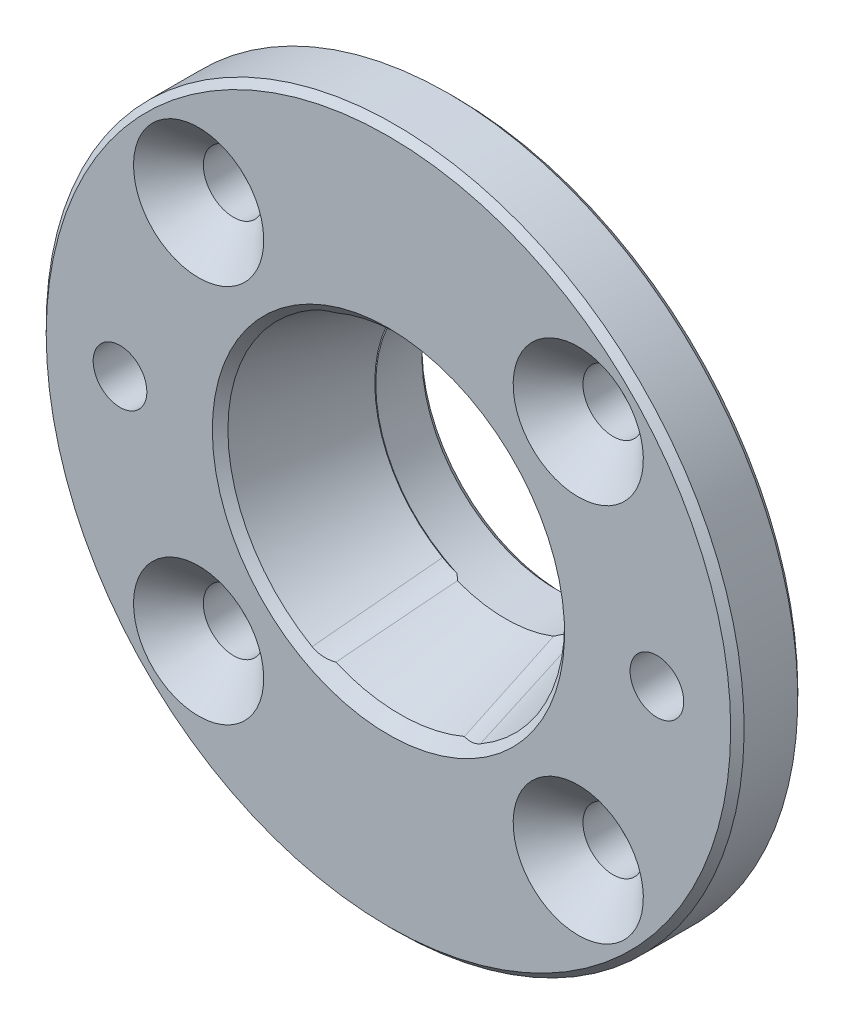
ISO-10303-21;
HEADER;
FILE_DESCRIPTION(('STEP AP214'),'2;1');
FILE_NAME('part.step','',(''),(''),'','','');
FILE_SCHEMA(('AUTOMOTIVE_DESIGN { 1 0 10303 214 1 1 1 1 }'));
ENDSEC;
DATA;
#1=APPLICATION_CONTEXT('core data for automotive mechanical design processes');
#2=APPLICATION_PROTOCOL_DEFINITION('international standard','automotive_design',2000,#1);
#3=PRODUCT_CONTEXT('',#1,'mechanical');
#4=PRODUCT('Part','Part','',(#3));
#5=PRODUCT_RELATED_PRODUCT_CATEGORY('part','',(#4));
#6=PRODUCT_DEFINITION_FORMATION('','',#4);
#7=PRODUCT_DEFINITION_CONTEXT('part definition',#1,'design');
#8=PRODUCT_DEFINITION('design','',#6,#7);
#9=PRODUCT_DEFINITION_SHAPE('','',#8);
#10=(LENGTH_UNIT() NAMED_UNIT(*) SI_UNIT(.MILLI.,.METRE.));
#11=(NAMED_UNIT(*) PLANE_ANGLE_UNIT() SI_UNIT($,.RADIAN.));
#12=(NAMED_UNIT(*) SI_UNIT($,.STERADIAN.) SOLID_ANGLE_UNIT());
#13=UNCERTAINTY_MEASURE_WITH_UNIT(LENGTH_MEASURE(1.E-05),#10,'distance_accuracy_value','');
#14=(GEOMETRIC_REPRESENTATION_CONTEXT(3) GLOBAL_UNCERTAINTY_ASSIGNED_CONTEXT((#13)) GLOBAL_UNIT_ASSIGNED_CONTEXT((#10,
#11,#12)) REPRESENTATION_CONTEXT('',''));
#15=CARTESIAN_POINT('',(0.,0.,0.));
#16=DIRECTION('',(0.,0.,1.));
#17=DIRECTION('',(1.,0.,0.));
#18=AXIS2_PLACEMENT_3D('',#15,#16,#17);
#19=CARTESIAN_POINT('',(0.,0.,-8.71853610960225));
#20=DIRECTION('',(0.,0.,1.));
#21=DIRECTION('',(0.,-1.,0.));
#22=AXIS2_PLACEMENT_3D('',#19,#20,#21);
#23=CONICAL_SURFACE('',#22,10.,0.279252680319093);
#24=CARTESIAN_POINT('',(0.,0.,-0.871853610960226));
#25=DIRECTION('',(0.,0.,-1.));
#26=DIRECTION('',(0.,1.,0.));
#27=AXIS2_PLACEMENT_3D('',#24,#25,#26);
#28=CIRCLE('',#27,12.25);
#29=CARTESIAN_POINT('',(-4.7905868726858,11.2744302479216,-0.871853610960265));
#30=VERTEX_POINT('',#29);
#31=CARTESIAN_POINT('',(4.7905868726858,11.2744302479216,-0.871853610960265));
#32=VERTEX_POINT('',#31);
#33=EDGE_CURVE('E107',#30,#32,#28,.T.);
#34=ORIENTED_EDGE('',*,*,#33,.F.);
#35=CARTESIAN_POINT('',(-3.58446799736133,9.33544011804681,-8.71873610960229));
#36=CARTESIAN_POINT('',(-3.68495233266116,9.49338701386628,-8.07888587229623));
#37=CARTESIAN_POINT('',(-3.78477794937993,9.65140086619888,-7.4389491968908));
#38=CARTESIAN_POINT('',(-3.98333773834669,9.96754553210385,-6.15893602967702));
#39=CARTESIAN_POINT('',(-4.08207191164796,10.1256763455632,-5.51885953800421));
#40=CARTESIAN_POINT('',(-4.37697578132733,10.6002180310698,-3.5984730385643));
#41=CARTESIAN_POINT('',(-4.57184760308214,10.9167793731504,-2.31800104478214));
#42=CARTESIAN_POINT('',(-5.04647304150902,11.6927921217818,0.819782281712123));
#43=CARTESIAN_POINT('',(-5.32494165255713,12.1524085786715,2.67724682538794));
#44=CARTESIAN_POINT('',(-5.74037783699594,12.8421560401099,5.46370674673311));
#45=CARTESIAN_POINT('',(-5.8784791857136,13.0721263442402,6.39257334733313));
#46=CARTESIAN_POINT('',(-6.15405458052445,13.5321581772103,8.25037658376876));
#47=CARTESIAN_POINT('',(-6.29152862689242,13.7622197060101,9.17931321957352));
#48=CARTESIAN_POINT('',(-6.42875336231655,13.9923189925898,10.1082773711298));
#49=B_SPLINE_CURVE_WITH_KNOTS('',3,(#35,#36,#37,#38,#39,#40,#41,#42,#43,#44,#45,#46,#47,#48),
.UNSPECIFIED.,.F.,.F.,(4,2,2,2,2,2,4),(0.,2.00001744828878,4.00003296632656,8.00004849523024,
13.8009664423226,16.7014427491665,19.6019177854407),.UNSPECIFIED.);
#50=CARTESIAN_POINT('',(-3.58449940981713,9.33548948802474,-8.71853610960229));
#51=VERTEX_POINT('',#50);
#52=EDGE_CURVE('E248',#51,#30,#49,.T.);
#53=ORIENTED_EDGE('',*,*,#52,.F.);
#54=CARTESIAN_POINT('',(0.,0.,-8.71853610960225));
#55=DIRECTION('',(0.,0.,1.));
#56=DIRECTION('',(0.,-1.,0.));
#57=AXIS2_PLACEMENT_3D('',#54,#55,#56);
#58=CIRCLE('',#57,10.);
#59=CARTESIAN_POINT('',(3.58449940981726,9.33548948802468,-8.71853610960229));
#60=VERTEX_POINT('',#59);
#61=EDGE_CURVE('E127',#60,#51,#58,.T.);
#62=ORIENTED_EDGE('',*,*,#61,.F.);
#63=CARTESIAN_POINT('',(4.92224307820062,11.4901243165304,0.000199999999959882));
#64=CARTESIAN_POINT('',(4.82569621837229,11.3317292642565,-0.640142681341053));
#65=CARTESIAN_POINT('',(4.72888260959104,11.1733690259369,-1.28045360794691));
#66=CARTESIAN_POINT('',(4.53460432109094,10.8567293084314,-2.56099757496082));
#67=CARTESIAN_POINT('',(4.4371396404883,10.6984498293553,-3.20123061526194));
#68=CARTESIAN_POINT('',(4.14359414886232,10.2237516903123,-5.12178138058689));
#69=CARTESIAN_POINT('',(3.94636078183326,9.90747150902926,-6.40195810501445));
#70=CARTESIAN_POINT('',(3.69283059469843,9.50608865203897,-8.02748496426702));
#71=CARTESIAN_POINT('',(3.63874462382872,9.42075464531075,-8.37312307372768));
#72=CARTESIAN_POINT('',(3.58446799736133,9.33544011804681,-8.71873610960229));
#73=B_SPLINE_CURVE_WITH_KNOTS('',3,(#63,#64,#65,#66,#67,#68,#69,#70,#71,#72),.UNSPECIFIED.,.F.,
.F.,(4,2,2,2,4),(0.,2.0000099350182,4.00002258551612,8.00002491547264,9.08032845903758),.UNSPECIFIED.);
#74=EDGE_CURVE('E120',#32,#60,#73,.T.);
#75=ORIENTED_EDGE('',*,*,#74,.F.);
#76=EDGE_LOOP('',(#34,#53,#62,#75));
#77=FACE_BOUND('',#76,.T.);
#78=ADVANCED_FACE('F16',(#77),#23,.F.);
#79=CARTESIAN_POINT('',(0.,0.,0.));
#80=DIRECTION('',(0.,0.,1.));
#81=DIRECTION('',(0.,-1.,0.));
#82=AXIS2_PLACEMENT_3D('',#79,#80,#81);
#83=CYLINDRICAL_SURFACE('',#82,10.);
#84=CARTESIAN_POINT('',(0.,0.,-6.18784099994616));
#85=DIRECTION('',(0.1378186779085,0.238708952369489,-0.96126169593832));
#86=DIRECTION('',(0.480630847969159,0.832477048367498,0.275637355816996));
#87=AXIS2_PLACEMENT_3D('',#84,#85,#86);
#88=ELLIPSE('',#87,10.402994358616,10.);
#89=CARTESIAN_POINT('',(-3.93397527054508,-9.19368471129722,-9.03492221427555));
#90=VERTEX_POINT('',#89);
#91=CARTESIAN_POINT('',(-5.,-8.66025403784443,-9.05529485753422));
#92=VERTEX_POINT('',#91);
#93=EDGE_CURVE('E326',#90,#92,#88,.T.);
#94=ORIENTED_EDGE('',*,*,#93,.F.);
#95=CARTESIAN_POINT('',(-3.58449940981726,-9.33548948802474,-8.71853610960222));
#96=CARTESIAN_POINT('',(-3.61195028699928,-9.32494899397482,-8.74724675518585));
#97=CARTESIAN_POINT('',(-3.63982012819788,-9.31410934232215,-8.77545242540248));
#98=CARTESIAN_POINT('',(-3.6963613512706,-9.29181555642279,-8.83069659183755));
#99=CARTESIAN_POINT('',(-3.72503137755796,-9.28036243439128,-8.85773688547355));
#100=CARTESIAN_POINT('',(-3.78322599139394,-9.25679137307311,-8.91058715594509));
#101=CARTESIAN_POINT('',(-3.81275062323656,-9.24467339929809,-8.93639706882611));
#102=CARTESIAN_POINT('',(-3.87269905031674,-9.21972107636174,-8.98669608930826));
#103=CARTESIAN_POINT('',(-3.90312421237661,-9.2068856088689,-9.01118301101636));
#104=CARTESIAN_POINT('',(-3.93397527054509,-9.19368471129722,-9.03492221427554));
#105=B_SPLINE_CURVE_WITH_KNOTS('',3,(#95,#96,#97,#98,#99,#100,#101,#102,#103,#104),
.UNSPECIFIED.,.F.,.F.,(4,2,2,2,4),(0.,0.123289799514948,0.246382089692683,0.369480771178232,
0.492776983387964),.UNSPECIFIED.);
#106=CARTESIAN_POINT('',(-3.58449940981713,-9.33548948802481,-8.71853610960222));
#107=VERTEX_POINT('',#106);
#108=EDGE_CURVE('E396',#107,#90,#105,.T.);
#109=ORIENTED_EDGE('',*,*,#108,.F.);
#110=CARTESIAN_POINT('',(3.58449940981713,-9.33548948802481,-8.71853610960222));
#111=VERTEX_POINT('',#110);
#112=EDGE_CURVE('E331',#107,#111,#58,.T.);
#113=ORIENTED_EDGE('',*,*,#112,.T.);
#114=CARTESIAN_POINT('',(3.93397527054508,-9.19368471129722,-9.03492221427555));
#115=CARTESIAN_POINT('',(3.90312421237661,-9.2068856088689,-9.01118301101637));
#116=CARTESIAN_POINT('',(3.87269905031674,-9.21972107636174,-8.98669608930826));
#117=CARTESIAN_POINT('',(3.81275062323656,-9.24467339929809,-8.93639706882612));
#118=CARTESIAN_POINT('',(3.78322599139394,-9.25679137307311,-8.91058715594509));
#119=CARTESIAN_POINT('',(3.72503137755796,-9.28036243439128,-8.85773688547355));
#120=CARTESIAN_POINT('',(3.6963613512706,-9.29181555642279,-8.83069659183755));
#121=CARTESIAN_POINT('',(3.63982012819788,-9.31410934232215,-8.77545242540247));
#122=CARTESIAN_POINT('',(3.61195028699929,-9.32494899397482,-8.74724675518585));
#123=CARTESIAN_POINT('',(3.58449940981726,-9.33548948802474,-8.71853610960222));
#124=B_SPLINE_CURVE_WITH_KNOTS('',3,(#114,#115,#116,#117,#118,#119,#120,#121,#122,#123),
.UNSPECIFIED.,.F.,.F.,(4,2,2,2,4),(0.,0.123296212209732,0.246394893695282,0.369487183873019,
0.492776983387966),.UNSPECIFIED.);
#125=CARTESIAN_POINT('',(3.93397527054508,-9.19368471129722,-9.03492221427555));
#126=VERTEX_POINT('',#125);
#127=EDGE_CURVE('E221',#126,#111,#124,.T.);
#128=ORIENTED_EDGE('',*,*,#127,.F.);
#129=CARTESIAN_POINT('',(0.,0.,-6.18784099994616));
#130=DIRECTION('',(-0.1378186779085,0.238708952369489,-0.96126169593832));
#131=DIRECTION('',(-0.480630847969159,0.832477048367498,0.275637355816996));
#132=AXIS2_PLACEMENT_3D('',#129,#130,#131);
#133=ELLIPSE('',#132,10.402994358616,10.);
#134=CARTESIAN_POINT('',(5.,-8.66025403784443,-9.05529485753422));
#135=VERTEX_POINT('',#134);
#136=EDGE_CURVE('E133',#135,#126,#133,.T.);
#137=ORIENTED_EDGE('',*,*,#136,.F.);
#138=CARTESIAN_POINT('',(0.,0.,-9.05529485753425));
#139=DIRECTION('',(0.,0.,-1.));
#140=DIRECTION('',(0.,1.,0.));
#141=AXIS2_PLACEMENT_3D('',#138,#139,#140);
#142=CIRCLE('',#141,10.);
#143=CARTESIAN_POINT('',(5.,8.66025403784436,-9.05529485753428));
#144=VERTEX_POINT('',#143);
#145=EDGE_CURVE('E361',#135,#144,#142,.F.);
#146=ORIENTED_EDGE('',*,*,#145,.T.);
#147=CARTESIAN_POINT('',(0.,0.,-6.18784099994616));
#148=DIRECTION('',(-0.1378186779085,-0.238708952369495,-0.961261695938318));
#149=DIRECTION('',(-0.480630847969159,-0.832477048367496,0.275637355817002));
#150=AXIS2_PLACEMENT_3D('',#147,#148,#149);
#151=ELLIPSE('',#150,10.402994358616,10.);
#152=CARTESIAN_POINT('',(3.93397527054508,9.19368471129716,-9.03492221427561));
#153=VERTEX_POINT('',#152);
#154=EDGE_CURVE('E131',#153,#144,#151,.T.);
#155=ORIENTED_EDGE('',*,*,#154,.F.);
#156=CARTESIAN_POINT('',(3.58449940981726,9.33548948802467,-8.71853610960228));
#157=CARTESIAN_POINT('',(3.61195028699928,9.32494899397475,-8.74724675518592));
#158=CARTESIAN_POINT('',(3.63982012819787,9.31410934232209,-8.77545242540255));
#159=CARTESIAN_POINT('',(3.6963613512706,9.29181555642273,-8.83069659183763));
#160=CARTESIAN_POINT('',(3.72503137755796,9.28036243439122,-8.85773688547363));
#161=CARTESIAN_POINT('',(3.78322599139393,9.25679137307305,-8.91058715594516));
#162=CARTESIAN_POINT('',(3.81275062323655,9.24467339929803,-8.93639706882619));
#163=CARTESIAN_POINT('',(3.87269905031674,9.21972107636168,-8.98669608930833));
#164=CARTESIAN_POINT('',(3.90312421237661,9.20688560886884,-9.01118301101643));
#165=CARTESIAN_POINT('',(3.93397527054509,9.19368471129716,-9.03492221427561));
#166=B_SPLINE_CURVE_WITH_KNOTS('',3,(#156,#157,#158,#159,#160,#161,#162,#163,#164,#165),
.UNSPECIFIED.,.F.,.F.,(4,2,2,2,4),(0.,0.123289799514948,0.246382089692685,0.369480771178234,
0.492776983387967),.UNSPECIFIED.);
#167=EDGE_CURVE('E128',#60,#153,#166,.T.);
#168=ORIENTED_EDGE('',*,*,#167,.F.);
#169=ORIENTED_EDGE('',*,*,#61,.T.);
#170=CARTESIAN_POINT('',(-3.93397527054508,9.19368471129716,-9.03492221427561));
#171=CARTESIAN_POINT('',(-3.9031242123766,9.20688560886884,-9.01118301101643));
#172=CARTESIAN_POINT('',(-3.87269905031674,9.21972107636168,-8.98669608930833));
#173=CARTESIAN_POINT('',(-3.81275062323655,9.24467339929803,-8.93639706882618));
#174=CARTESIAN_POINT('',(-3.78322599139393,9.25679137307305,-8.91058715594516));
#175=CARTESIAN_POINT('',(-3.72503137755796,9.28036243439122,-8.85773688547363));
#176=CARTESIAN_POINT('',(-3.6963613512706,9.29181555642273,-8.83069659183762));
#177=CARTESIAN_POINT('',(-3.63982012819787,9.31410934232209,-8.77545242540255));
#178=CARTESIAN_POINT('',(-3.61195028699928,9.32494899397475,-8.74724675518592));
#179=CARTESIAN_POINT('',(-3.58449940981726,9.33548948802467,-8.71853610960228));
#180=B_SPLINE_CURVE_WITH_KNOTS('',3,(#170,#171,#172,#173,#174,#175,#176,#177,#178,#179),
.UNSPECIFIED.,.F.,.F.,(4,2,2,2,4),(0.,0.123296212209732,0.246394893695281,0.369487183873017,
0.492776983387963),.UNSPECIFIED.);
#181=CARTESIAN_POINT('',(-3.93397527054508,9.19368471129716,-9.03492221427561));
#182=VERTEX_POINT('',#181);
#183=EDGE_CURVE('E240',#182,#51,#180,.T.);
#184=ORIENTED_EDGE('',*,*,#183,.F.);
#185=CARTESIAN_POINT('',(0.,0.,-6.18784099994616));
#186=DIRECTION('',(0.1378186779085,-0.238708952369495,-0.961261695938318));
#187=DIRECTION('',(0.480630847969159,-0.832477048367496,0.275637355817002));
#188=AXIS2_PLACEMENT_3D('',#185,#186,#187);
#189=ELLIPSE('',#188,10.402994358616,10.);
#190=CARTESIAN_POINT('',(-5.,8.66025403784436,-9.05529485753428));
#191=VERTEX_POINT('',#190);
#192=EDGE_CURVE('E247',#191,#182,#189,.T.);
#193=ORIENTED_EDGE('',*,*,#192,.F.);
#194=CARTESIAN_POINT('',(0.,0.,-9.05529485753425));
#195=DIRECTION('',(0.,0.,-1.));
#196=DIRECTION('',(0.,1.,0.));
#197=AXIS2_PLACEMENT_3D('',#194,#195,#196);
#198=CIRCLE('',#197,10.);
#199=EDGE_CURVE('E363',#191,#92,#198,.F.);
#200=ORIENTED_EDGE('',*,*,#199,.T.);
#201=EDGE_LOOP('',(#94,#109,#113,#128,#137,#146,#155,#168,#169,#184,#193,#200));
#202=FACE_BOUND('',#201,.T.);
#203=CARTESIAN_POINT('',(0.,0.,-12.5));
#204=DIRECTION('',(0.,0.,-1.));
#205=DIRECTION('',(0.,1.,0.));
#206=AXIS2_PLACEMENT_3D('',#203,#204,#205);
#207=CIRCLE('',#206,10.);
#208=CARTESIAN_POINT('',(0.,9.99999999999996,-12.5));
#209=VERTEX_POINT('',#208);
#210=EDGE_CURVE('E352',#209,#209,#207,.T.);
#211=ORIENTED_EDGE('',*,*,#210,.T.);
#212=EDGE_LOOP('',(#211));
#213=FACE_BOUND('',#212,.T.);
#214=ADVANCED_FACE('F227',(#202,#213),#83,.F.);
#215=CARTESIAN_POINT('',(12.5,0.,0.));
#216=DIRECTION('',(0.,0.,1.));
#217=DIRECTION('',(0.,-1.,0.));
#218=AXIS2_PLACEMENT_3D('',#215,#216,#217);
#219=PLANE('',#218);
#220=CARTESIAN_POINT('',(-20.,0.,0.));
#221=DIRECTION('',(0.,0.,1.));
#222=DIRECTION('',(1.,0.,0.));
#223=AXIS2_PLACEMENT_3D('',#220,#221,#222);
#224=CIRCLE('',#223,2.);
#225=CARTESIAN_POINT('',(-18.,0.,0.));
#226=VERTEX_POINT('',#225);
#227=EDGE_CURVE('E378',#226,#226,#224,.T.);
#228=ORIENTED_EDGE('',*,*,#227,.F.);
#229=EDGE_LOOP('',(#228));
#230=FACE_BOUND('',#229,.T.);
#231=CARTESIAN_POINT('',(20.,2.91433543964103E-13,0.));
#232=DIRECTION('',(0.,0.,1.));
#233=DIRECTION('',(1.,0.,0.));
#234=AXIS2_PLACEMENT_3D('',#231,#232,#233);
#235=CIRCLE('',#234,2.);
#236=CARTESIAN_POINT('',(22.,2.91433543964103E-13,0.));
#237=VERTEX_POINT('',#236);
#238=EDGE_CURVE('E383',#237,#237,#235,.T.);
#239=ORIENTED_EDGE('',*,*,#238,.F.);
#240=EDGE_LOOP('',(#239));
#241=FACE_BOUND('',#240,.T.);
#242=CARTESIAN_POINT('',(0.,0.,0.));
#243=DIRECTION('',(0.,0.,-1.));
#244=DIRECTION('',(0.,1.,0.));
#245=AXIS2_PLACEMENT_3D('',#242,#243,#244);
#246=CIRCLE('',#245,13.1218536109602);
#247=CARTESIAN_POINT('',(0.,13.1218536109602,0.));
#248=VERTEX_POINT('',#247);
#249=EDGE_CURVE('E296',#248,#248,#246,.T.);
#250=ORIENTED_EDGE('',*,*,#249,.T.);
#251=EDGE_LOOP('',(#250));
#252=FACE_BOUND('',#251,.T.);
#253=CARTESIAN_POINT('',(0.,0.,0.));
#254=DIRECTION('',(0.,0.,1.));
#255=DIRECTION('',(0.,-1.,0.));
#256=AXIS2_PLACEMENT_3D('',#253,#254,#255);
#257=CIRCLE('',#256,25.5);
#258=CARTESIAN_POINT('',(0.,-25.5,0.));
#259=VERTEX_POINT('',#258);
#260=EDGE_CURVE('E355',#259,#259,#257,.T.);
#261=ORIENTED_EDGE('',*,*,#260,.T.);
#262=EDGE_LOOP('',(#261));
#263=FACE_BOUND('',#262,.T.);
#264=CARTESIAN_POINT('',(14.1421356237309,14.142135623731,0.));
#265=DIRECTION('',(0.,0.,1.));
#266=DIRECTION('',(0.,-1.,0.));
#267=AXIS2_PLACEMENT_3D('',#264,#265,#266);
#268=CIRCLE('',#267,4.85);
#269=CARTESIAN_POINT('',(14.1421356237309,9.29213562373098,0.));
#270=VERTEX_POINT('',#269);
#271=EDGE_CURVE('E420',#270,#270,#268,.T.);
#272=ORIENTED_EDGE('',*,*,#271,.F.);
#273=EDGE_LOOP('',(#272));
#274=FACE_BOUND('',#273,.T.);
#275=CARTESIAN_POINT('',(14.142135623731,-14.1421356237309,0.));
#276=DIRECTION('',(0.,0.,1.));
#277=DIRECTION('',(0.,-1.,0.));
#278=AXIS2_PLACEMENT_3D('',#275,#276,#277);
#279=CIRCLE('',#278,4.85);
#280=CARTESIAN_POINT('',(14.142135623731,-18.9921356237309,0.));
#281=VERTEX_POINT('',#280);
#282=EDGE_CURVE('E430',#281,#281,#279,.T.);
#283=ORIENTED_EDGE('',*,*,#282,.F.);
#284=EDGE_LOOP('',(#283));
#285=FACE_BOUND('',#284,.T.);
#286=CARTESIAN_POINT('',(-14.1421356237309,-14.142135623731,0.));
#287=DIRECTION('',(0.,0.,1.));
#288=DIRECTION('',(0.,-1.,0.));
#289=AXIS2_PLACEMENT_3D('',#286,#287,#288);
#290=CIRCLE('',#289,4.85);
#291=CARTESIAN_POINT('',(-14.1421356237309,-18.992135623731,0.));
#292=VERTEX_POINT('',#291);
#293=EDGE_CURVE('E436',#292,#292,#290,.T.);
#294=ORIENTED_EDGE('',*,*,#293,.F.);
#295=EDGE_LOOP('',(#294));
#296=FACE_BOUND('',#295,.T.);
#297=CARTESIAN_POINT('',(-14.142135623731,14.1421356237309,0.));
#298=DIRECTION('',(0.,0.,1.));
#299=DIRECTION('',(0.,-1.,0.));
#300=AXIS2_PLACEMENT_3D('',#297,#298,#299);
#301=CIRCLE('',#300,4.85);
#302=CARTESIAN_POINT('',(-14.142135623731,9.29213562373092,0.));
#303=VERTEX_POINT('',#302);
#304=EDGE_CURVE('E442',#303,#303,#301,.T.);
#305=ORIENTED_EDGE('',*,*,#304,.F.);
#306=EDGE_LOOP('',(#305));
#307=FACE_BOUND('',#306,.T.);
#308=ADVANCED_FACE('F231',(#230,#241,#252,#263,#274,#285,#296,#307),#219,.T.);
#309=CARTESIAN_POINT('',(4.7905868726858,-11.2744302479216,-0.871853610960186));
#310=VERTEX_POINT('',#309);
#311=CARTESIAN_POINT('',(-4.79058687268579,-11.2744302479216,-0.871853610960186));
#312=VERTEX_POINT('',#311);
#313=EDGE_CURVE('E33',#310,#312,#28,.T.);
#314=ORIENTED_EDGE('',*,*,#313,.F.);
#315=CARTESIAN_POINT('',(3.58446799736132,-9.33544011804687,-8.71873610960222));
#316=CARTESIAN_POINT('',(3.68495312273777,-9.49338687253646,-8.07888629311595));
#317=CARTESIAN_POINT('',(3.784778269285,-9.65140067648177,-7.43894988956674));
#318=CARTESIAN_POINT('',(3.98333712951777,-9.96754526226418,-6.15893719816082));
#319=CARTESIAN_POINT('',(4.08207084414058,-10.1256760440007,-5.51886091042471));
#320=CARTESIAN_POINT('',(4.3769772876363,-10.6002176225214,-3.59847438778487));
#321=CARTESIAN_POINT('',(4.57185592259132,-10.9167786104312,-2.31800261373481));
#322=CARTESIAN_POINT('',(4.81786655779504,-11.3190243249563,-0.691536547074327));
#323=CARTESIAN_POINT('',(4.8700924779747,-11.4045693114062,-0.345672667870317));
#324=CARTESIAN_POINT('',(4.92224307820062,-11.4901243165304,0.000200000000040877));
#325=B_SPLINE_CURVE_WITH_KNOTS('',3,(#315,#316,#317,#318,#319,#320,#321,#322,#323,#324),
.UNSPECIFIED.,.F.,.F.,(4,2,2,2,4),(0.,2.00001644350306,4.0000311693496,8.00004849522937,
9.08032884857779),.UNSPECIFIED.);
#326=EDGE_CURVE('E214',#111,#310,#325,.T.);
#327=ORIENTED_EDGE('',*,*,#326,.F.);
#328=ORIENTED_EDGE('',*,*,#112,.F.);
#329=CARTESIAN_POINT('',(-2.33020401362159,-7.44398877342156,-16.3902175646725));
#330=CARTESIAN_POINT('',(-2.44058019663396,-7.60122917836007,-15.751797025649));
#331=CARTESIAN_POINT('',(-2.5489314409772,-7.7585779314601,-15.1130583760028));
#332=CARTESIAN_POINT('',(-2.76247439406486,-8.07347257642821,-13.8351070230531));
#333=CARTESIAN_POINT('',(-2.86766613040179,-8.23101846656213,-13.1958943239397));
#334=CARTESIAN_POINT('',(-3.07578003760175,-8.54628713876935,-11.917159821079));
#335=CARTESIAN_POINT('',(-3.17870225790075,-8.70400991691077,-11.2776380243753));
#336=CARTESIAN_POINT('',(-3.38279620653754,-9.01961266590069,-9.99835243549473));
#337=CARTESIAN_POINT('',(-3.48396793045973,-9.17749263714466,-9.35858864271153));
#338=CARTESIAN_POINT('',(-3.78546502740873,-9.65133020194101,-7.43905080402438));
#339=CARTESIAN_POINT('',(-3.98377551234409,-9.96749031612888,-6.15901054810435));
#340=CARTESIAN_POINT('',(-4.37696486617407,-10.6002138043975,-3.59849009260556));
#341=CARTESIAN_POINT('',(-4.57184369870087,-10.9167771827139,-2.31800988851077));
#342=CARTESIAN_POINT('',(-5.04648052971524,-11.6927982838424,0.819807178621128));
#343=CARTESIAN_POINT('',(-5.32495006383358,-12.1524212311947,2.67729795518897));
#344=CARTESIAN_POINT('',(-5.74038701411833,-12.842171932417,5.46377094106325));
#345=CARTESIAN_POINT('',(-5.87848662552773,-13.0721390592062,6.39262470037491));
#346=CARTESIAN_POINT('',(-6.15405856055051,-13.5321645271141,8.25040222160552));
#347=CARTESIAN_POINT('',(-6.29153088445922,-13.7622228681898,9.17932598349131));
#348=CARTESIAN_POINT('',(-6.42875336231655,-13.9923189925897,10.1082773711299));
#349=B_SPLINE_CURVE_WITH_KNOTS('',3,(#329,#330,#331,#332,#333,#334,#335,#336,#337,#338,#339,
#340,#341,#342,#343,#344,#345,#346,#347,#348),.UNSPECIFIED.,.F.,.F.,(4,2,2,2,2,2,2,2,2,4),(0.,
2.00008810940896,4.00015874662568,6.00018577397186,8.00021784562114,12.0002202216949,
16.0002649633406,21.8012629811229,24.7016993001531,27.6021342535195),.UNSPECIFIED.);
#350=EDGE_CURVE('E295',#312,#107,#349,.F.);
#351=ORIENTED_EDGE('',*,*,#350,.F.);
#352=EDGE_LOOP('',(#314,#327,#328,#351));
#353=FACE_BOUND('',#352,.T.);
#354=ADVANCED_FACE('F148',(#353),#23,.F.);
#355=CARTESIAN_POINT('',(10.,0.,-13.));
#356=DIRECTION('',(0.,0.,-1.));
#357=DIRECTION('',(0.,1.,0.));
#358=AXIS2_PLACEMENT_3D('',#355,#356,#357);
#359=PLANE('',#358);
#360=CARTESIAN_POINT('',(0.,0.,-13.));
#361=DIRECTION('',(0.,0.,-1.));
#362=DIRECTION('',(0.,1.,0.));
#363=AXIS2_PLACEMENT_3D('',#360,#361,#362);
#364=CIRCLE('',#363,10.5);
#365=CARTESIAN_POINT('',(0.,10.5,-13.));
#366=VERTEX_POINT('',#365);
#367=EDGE_CURVE('E349',#366,#366,#364,.F.);
#368=ORIENTED_EDGE('',*,*,#367,.T.);
#369=EDGE_LOOP('',(#368));
#370=FACE_BOUND('',#369,.T.);
#371=CARTESIAN_POINT('',(0.,0.,-13.));
#372=DIRECTION('',(0.,0.,-1.));
#373=DIRECTION('',(0.,1.,0.));
#374=AXIS2_PLACEMENT_3D('',#371,#372,#373);
#375=CIRCLE('',#374,13.4);
#376=CARTESIAN_POINT('',(0.,13.4,-13.));
#377=VERTEX_POINT('',#376);
#378=EDGE_CURVE('E345',#377,#377,#375,.T.);
#379=ORIENTED_EDGE('',*,*,#378,.T.);
#380=EDGE_LOOP('',(#379));
#381=FACE_BOUND('',#380,.T.);
#382=ADVANCED_FACE('F233',(#370,#381),#359,.T.);
#383=CARTESIAN_POINT('',(0.,0.,0.));
#384=DIRECTION('',(0.,0.,1.));
#385=DIRECTION('',(0.,-1.,0.));
#386=AXIS2_PLACEMENT_3D('',#383,#384,#385);
#387=CYLINDRICAL_SURFACE('',#386,14.);
#388=CARTESIAN_POINT('',(0.,0.,-7.));
#389=DIRECTION('',(0.,0.,1.));
#390=DIRECTION('',(0.,-1.,0.));
#391=AXIS2_PLACEMENT_3D('',#388,#389,#390);
#392=CIRCLE('',#391,14.);
#393=CARTESIAN_POINT('',(0.,-14.,-6.99999999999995));
#394=VERTEX_POINT('',#393);
#395=EDGE_CURVE('E448',#394,#394,#392,.T.);
#396=ORIENTED_EDGE('',*,*,#395,.F.);
#397=EDGE_LOOP('',(#396));
#398=FACE_BOUND('',#397,.T.);
#399=CARTESIAN_POINT('',(0.,0.,-10.9));
#400=DIRECTION('',(0.,0.,1.));
#401=DIRECTION('',(0.,-1.,0.));
#402=AXIS2_PLACEMENT_3D('',#399,#400,#401);
#403=CIRCLE('',#402,14.);
#404=CARTESIAN_POINT('',(0.,-14.,-10.9));
#405=VERTEX_POINT('',#404);
#406=EDGE_CURVE('E336',#405,#405,#403,.T.);
#407=ORIENTED_EDGE('',*,*,#406,.T.);
#408=EDGE_LOOP('',(#407));
#409=FACE_BOUND('',#408,.T.);
#410=ADVANCED_FACE('F287',(#398,#409),#387,.T.);
#411=CARTESIAN_POINT('',(14.,0.,-5.));
#412=DIRECTION('',(0.,0.,-1.));
#413=DIRECTION('',(0.,1.,0.));
#414=AXIS2_PLACEMENT_3D('',#411,#412,#413);
#415=PLANE('',#414);
#416=CARTESIAN_POINT('',(-20.,0.,-5.));
#417=DIRECTION('',(0.,0.,-1.));
#418=DIRECTION('',(0.,1.,0.));
#419=AXIS2_PLACEMENT_3D('',#416,#417,#418);
#420=CIRCLE('',#419,2.);
#421=CARTESIAN_POINT('',(-20.,2.,-5.00000000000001));
#422=VERTEX_POINT('',#421);
#423=EDGE_CURVE('E20',#422,#422,#420,.T.);
#424=ORIENTED_EDGE('',*,*,#423,.F.);
#425=EDGE_LOOP('',(#424));
#426=FACE_BOUND('',#425,.T.);
#427=CARTESIAN_POINT('',(20.,2.91433543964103E-13,-5.));
#428=DIRECTION('',(0.,0.,-1.));
#429=DIRECTION('',(0.,1.,0.));
#430=AXIS2_PLACEMENT_3D('',#427,#428,#429);
#431=CIRCLE('',#430,2.);
#432=CARTESIAN_POINT('',(20.,2.00000000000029,-5.00000000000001));
#433=VERTEX_POINT('',#432);
#434=EDGE_CURVE('E376',#433,#433,#431,.T.);
#435=ORIENTED_EDGE('',*,*,#434,.F.);
#436=EDGE_LOOP('',(#435));
#437=FACE_BOUND('',#436,.T.);
#438=CARTESIAN_POINT('',(-14.1421356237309,-14.142135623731,-5.));
#439=DIRECTION('',(0.,0.,-1.));
#440=DIRECTION('',(0.,1.,0.));
#441=AXIS2_PLACEMENT_3D('',#438,#439,#440);
#442=CIRCLE('',#441,2.25);
#443=CARTESIAN_POINT('',(-14.1421356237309,-11.892135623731,-5.00000000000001));
#444=VERTEX_POINT('',#443);
#445=EDGE_CURVE('E10',#444,#444,#442,.T.);
#446=ORIENTED_EDGE('',*,*,#445,.F.);
#447=EDGE_LOOP('',(#446));
#448=FACE_BOUND('',#447,.T.);
#449=CARTESIAN_POINT('',(-14.142135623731,14.1421356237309,-5.));
#450=DIRECTION('',(0.,0.,-1.));
#451=DIRECTION('',(0.,1.,0.));
#452=AXIS2_PLACEMENT_3D('',#449,#450,#451);
#453=CIRCLE('',#452,2.25);
#454=CARTESIAN_POINT('',(-14.142135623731,16.3921356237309,-5.00000000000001));
#455=VERTEX_POINT('',#454);
#456=EDGE_CURVE('E25',#455,#455,#453,.T.);
#457=ORIENTED_EDGE('',*,*,#456,.F.);
#458=EDGE_LOOP('',(#457));
#459=FACE_BOUND('',#458,.T.);
#460=CARTESIAN_POINT('',(14.1421356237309,14.142135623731,-5.));
#461=DIRECTION('',(0.,0.,-1.));
#462=DIRECTION('',(0.,1.,0.));
#463=AXIS2_PLACEMENT_3D('',#460,#461,#462);
#464=CIRCLE('',#463,2.25);
#465=CARTESIAN_POINT('',(14.1421356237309,16.392135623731,-5.00000000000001));
#466=VERTEX_POINT('',#465);
#467=EDGE_CURVE('E367',#466,#466,#464,.T.);
#468=ORIENTED_EDGE('',*,*,#467,.F.);
#469=EDGE_LOOP('',(#468));
#470=FACE_BOUND('',#469,.T.);
#471=CARTESIAN_POINT('',(14.142135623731,-14.1421356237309,-5.));
#472=DIRECTION('',(0.,0.,-1.));
#473=DIRECTION('',(0.,1.,0.));
#474=AXIS2_PLACEMENT_3D('',#471,#472,#473);
#475=CIRCLE('',#474,2.25);
#476=CARTESIAN_POINT('',(14.142135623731,-11.8921356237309,-5.00000000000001));
#477=VERTEX_POINT('',#476);
#478=EDGE_CURVE('E364',#477,#477,#475,.T.);
#479=ORIENTED_EDGE('',*,*,#478,.F.);
#480=EDGE_LOOP('',(#479));
#481=FACE_BOUND('',#480,.T.);
#482=CARTESIAN_POINT('',(0.,0.,-5.));
#483=DIRECTION('',(0.,0.,1.));
#484=DIRECTION('',(0.,-1.,0.));
#485=AXIS2_PLACEMENT_3D('',#482,#483,#484);
#486=CIRCLE('',#485,15.);
#487=CARTESIAN_POINT('',(0.,-15.,-4.99999999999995));
#488=VERTEX_POINT('',#487);
#489=EDGE_CURVE('E457',#488,#488,#486,.T.);
#490=ORIENTED_EDGE('',*,*,#489,.T.);
#491=EDGE_LOOP('',(#490));
#492=FACE_BOUND('',#491,.T.);
#493=CARTESIAN_POINT('',(0.,0.,-5.));
#494=DIRECTION('',(0.,0.,-1.));
#495=DIRECTION('',(0.,1.,0.));
#496=AXIS2_PLACEMENT_3D('',#493,#494,#495);
#497=CIRCLE('',#496,25.5);
#498=CARTESIAN_POINT('',(0.,25.5,-5.00000000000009));
#499=VERTEX_POINT('',#498);
#500=EDGE_CURVE('E334',#499,#499,#497,.T.);
#501=ORIENTED_EDGE('',*,*,#500,.T.);
#502=EDGE_LOOP('',(#501));
#503=FACE_BOUND('',#502,.T.);
#504=ADVANCED_FACE('F486',(#426,#437,#448,#459,#470,#481,#492,#503),#415,.T.);
#505=CARTESIAN_POINT('',(0.,0.,0.));
#506=DIRECTION('',(0.,0.,1.));
#507=DIRECTION('',(0.,-1.,0.));
#508=AXIS2_PLACEMENT_3D('',#505,#506,#507);
#509=CYLINDRICAL_SURFACE('',#508,26.);
#510=CARTESIAN_POINT('',(0.,0.,-0.500000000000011));
#511=DIRECTION('',(0.,0.,1.));
#512=DIRECTION('',(0.,-1.,0.));
#513=AXIS2_PLACEMENT_3D('',#510,#511,#512);
#514=CIRCLE('',#513,26.);
#515=CARTESIAN_POINT('',(0.,-26.,-0.49999999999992));
#516=VERTEX_POINT('',#515);
#517=EDGE_CURVE('E358',#516,#516,#514,.F.);
#518=ORIENTED_EDGE('',*,*,#517,.T.);
#519=EDGE_LOOP('',(#518));
#520=FACE_BOUND('',#519,.T.);
#521=CARTESIAN_POINT('',(0.,0.,-4.5));
#522=DIRECTION('',(0.,0.,-1.));
#523=DIRECTION('',(0.,1.,0.));
#524=AXIS2_PLACEMENT_3D('',#521,#522,#523);
#525=CIRCLE('',#524,26.);
#526=CARTESIAN_POINT('',(0.,26.,-4.50000000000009));
#527=VERTEX_POINT('',#526);
#528=EDGE_CURVE('E330',#527,#527,#525,.F.);
#529=ORIENTED_EDGE('',*,*,#528,.T.);
#530=EDGE_LOOP('',(#529));
#531=FACE_BOUND('',#530,.T.);
#532=ADVANCED_FACE('F480',(#520,#531),#509,.T.);
#533=CARTESIAN_POINT('',(0.,0.,-4.5));
#534=DIRECTION('',(0.,0.,1.));
#535=DIRECTION('',(0.,-1.,0.));
#536=AXIS2_PLACEMENT_3D('',#533,#534,#535);
#537=CONICAL_SURFACE('',#536,26.,0.785398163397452);
#538=ORIENTED_EDGE('',*,*,#500,.F.);
#539=EDGE_LOOP('',(#538));
#540=FACE_BOUND('',#539,.T.);
#541=ORIENTED_EDGE('',*,*,#528,.F.);
#542=EDGE_LOOP('',(#541));
#543=FACE_BOUND('',#542,.T.);
#544=ADVANCED_FACE('F470',(#540,#543),#537,.T.);
#545=CARTESIAN_POINT('',(0.,0.,-11.));
#546=DIRECTION('',(0.,0.,1.));
#547=DIRECTION('',(0.,-1.,0.));
#548=AXIS2_PLACEMENT_3D('',#545,#546,#547);
#549=CONICAL_SURFACE('',#548,13.9,0.785398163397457);
#550=ORIENTED_EDGE('',*,*,#406,.F.);
#551=EDGE_LOOP('',(#550));
#552=FACE_BOUND('',#551,.T.);
#553=CARTESIAN_POINT('',(0.,0.,-11.));
#554=DIRECTION('',(0.,0.,1.));
#555=DIRECTION('',(0.,-1.,0.));
#556=AXIS2_PLACEMENT_3D('',#553,#554,#555);
#557=CIRCLE('',#556,13.9);
#558=CARTESIAN_POINT('',(0.,-13.9,-11.));
#559=VERTEX_POINT('',#558);
#560=EDGE_CURVE('E459',#559,#559,#557,.T.);
#561=ORIENTED_EDGE('',*,*,#560,.T.);
#562=EDGE_LOOP('',(#561));
#563=FACE_BOUND('',#562,.T.);
#564=ADVANCED_FACE('F467',(#552,#563),#549,.T.);
#565=CARTESIAN_POINT('',(0.,0.,0.));
#566=DIRECTION('',(0.,0.,1.));
#567=DIRECTION('',(0.,-1.,0.));
#568=AXIS2_PLACEMENT_3D('',#565,#566,#567);
#569=CYLINDRICAL_SURFACE('',#568,13.9);
#570=CARTESIAN_POINT('',(0.,0.,-12.5));
#571=DIRECTION('',(0.,0.,-1.));
#572=DIRECTION('',(0.,1.,0.));
#573=AXIS2_PLACEMENT_3D('',#570,#571,#572);
#574=CIRCLE('',#573,13.9);
#575=CARTESIAN_POINT('',(0.,13.9,-12.5));
#576=VERTEX_POINT('',#575);
#577=EDGE_CURVE('E342',#576,#576,#574,.F.);
#578=ORIENTED_EDGE('',*,*,#577,.T.);
#579=EDGE_LOOP('',(#578));
#580=FACE_BOUND('',#579,.T.);
#581=ORIENTED_EDGE('',*,*,#560,.F.);
#582=EDGE_LOOP('',(#581));
#583=FACE_BOUND('',#582,.T.);
#584=ADVANCED_FACE('F469',(#580,#583),#569,.T.);
#585=CARTESIAN_POINT('',(0.,0.,-12.5));
#586=DIRECTION('',(0.,0.,1.));
#587=DIRECTION('',(0.,-1.,0.));
#588=AXIS2_PLACEMENT_3D('',#585,#586,#587);
#589=CONICAL_SURFACE('',#588,13.9,0.785398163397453);
#590=ORIENTED_EDGE('',*,*,#378,.F.);
#591=EDGE_LOOP('',(#590));
#592=FACE_BOUND('',#591,.T.);
#593=ORIENTED_EDGE('',*,*,#577,.F.);
#594=EDGE_LOOP('',(#593));
#595=FACE_BOUND('',#594,.T.);
#596=ADVANCED_FACE('F477',(#592,#595),#589,.T.);
#597=CARTESIAN_POINT('',(0.,0.,-4.5));
#598=DIRECTION('',(0.,0.,-1.));
#599=DIRECTION('',(0.,1.,0.));
#600=AXIS2_PLACEMENT_3D('',#597,#598,#599);
#601=CONICAL_SURFACE('',#600,14.5,0.785398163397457);
#602=ORIENTED_EDGE('',*,*,#489,.F.);
#603=EDGE_LOOP('',(#602));
#604=FACE_BOUND('',#603,.T.);
#605=CARTESIAN_POINT('',(0.,0.,-4.5));
#606=DIRECTION('',(0.,0.,1.));
#607=DIRECTION('',(0.,-1.,0.));
#608=AXIS2_PLACEMENT_3D('',#605,#606,#607);
#609=CIRCLE('',#608,14.5);
#610=CARTESIAN_POINT('',(0.,-14.5,-4.49999999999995));
#611=VERTEX_POINT('',#610);
#612=EDGE_CURVE('E454',#611,#611,#609,.T.);
#613=ORIENTED_EDGE('',*,*,#612,.T.);
#614=EDGE_LOOP('',(#613));
#615=FACE_BOUND('',#614,.T.);
#616=ADVANCED_FACE('F520',(#604,#615),#601,.F.);
#617=CARTESIAN_POINT('',(13.5,0.,-4.5));
#618=DIRECTION('',(0.,0.,1.));
#619=DIRECTION('',(0.,-1.,0.));
#620=AXIS2_PLACEMENT_3D('',#617,#618,#619);
#621=PLANE('',#620);
#622=CARTESIAN_POINT('',(0.,0.,-4.5));
#623=DIRECTION('',(0.,0.,1.));
#624=DIRECTION('',(0.,-1.,0.));
#625=AXIS2_PLACEMENT_3D('',#622,#623,#624);
#626=CIRCLE('',#625,13.5);
#627=CARTESIAN_POINT('',(0.,-13.5,-4.49999999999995));
#628=VERTEX_POINT('',#627);
#629=EDGE_CURVE('E348',#628,#628,#626,.T.);
#630=ORIENTED_EDGE('',*,*,#629,.T.);
#631=EDGE_LOOP('',(#630));
#632=FACE_BOUND('',#631,.T.);
#633=ORIENTED_EDGE('',*,*,#612,.F.);
#634=EDGE_LOOP('',(#633));
#635=FACE_BOUND('',#634,.T.);
#636=ADVANCED_FACE('F511',(#632,#635),#621,.F.);
#637=CARTESIAN_POINT('',(0.,0.,0.));
#638=DIRECTION('',(0.,0.,1.));
#639=DIRECTION('',(0.,-1.,0.));
#640=AXIS2_PLACEMENT_3D('',#637,#638,#639);
#641=CYLINDRICAL_SURFACE('',#640,13.5);
#642=ORIENTED_EDGE('',*,*,#629,.F.);
#643=EDGE_LOOP('',(#642));
#644=FACE_BOUND('',#643,.T.);
#645=CARTESIAN_POINT('',(0.,0.,-6.5));
#646=DIRECTION('',(0.,0.,1.));
#647=DIRECTION('',(0.,-1.,0.));
#648=AXIS2_PLACEMENT_3D('',#645,#646,#647);
#649=CIRCLE('',#648,13.5);
#650=CARTESIAN_POINT('',(0.,-13.5,-6.49999999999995));
#651=VERTEX_POINT('',#650);
#652=EDGE_CURVE('E451',#651,#651,#649,.T.);
#653=ORIENTED_EDGE('',*,*,#652,.T.);
#654=EDGE_LOOP('',(#653));
#655=FACE_BOUND('',#654,.T.);
#656=ADVANCED_FACE('F500',(#644,#655),#641,.T.);
#657=CARTESIAN_POINT('',(0.,0.,-7.));
#658=DIRECTION('',(0.,0.,-1.));
#659=DIRECTION('',(0.,1.,0.));
#660=AXIS2_PLACEMENT_3D('',#657,#658,#659);
#661=CONICAL_SURFACE('',#660,14.,0.785398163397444);
#662=ORIENTED_EDGE('',*,*,#652,.F.);
#663=EDGE_LOOP('',(#662));
#664=FACE_BOUND('',#663,.T.);
#665=ORIENTED_EDGE('',*,*,#395,.T.);
#666=EDGE_LOOP('',(#665));
#667=FACE_BOUND('',#666,.T.);
#668=ADVANCED_FACE('F497',(#664,#667),#661,.T.);
#669=CARTESIAN_POINT('',(0.,0.,-13.));
#670=DIRECTION('',(0.,0.,-1.));
#671=DIRECTION('',(0.,1.,0.));
#672=AXIS2_PLACEMENT_3D('',#669,#670,#671);
#673=CONICAL_SURFACE('',#672,10.5,0.785398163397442);
#674=ORIENTED_EDGE('',*,*,#210,.F.);
#675=EDGE_LOOP('',(#674));
#676=FACE_BOUND('',#675,.T.);
#677=ORIENTED_EDGE('',*,*,#367,.F.);
#678=EDGE_LOOP('',(#677));
#679=FACE_BOUND('',#678,.T.);
#680=ADVANCED_FACE('F499',(#676,#679),#673,.F.);
#681=CARTESIAN_POINT('',(-14.142135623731,14.1421356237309,0.));
#682=DIRECTION('',(0.,0.,1.));
#683=DIRECTION('',(0.,-1.,0.));
#684=AXIS2_PLACEMENT_3D('',#681,#682,#683);
#685=CYLINDRICAL_SURFACE('',#684,2.25);
#686=CARTESIAN_POINT('',(-14.142135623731,14.1421356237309,-2.60000000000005));
#687=DIRECTION('',(0.,0.,1.));
#688=DIRECTION('',(0.,-1.,0.));
#689=AXIS2_PLACEMENT_3D('',#686,#687,#688);
#690=CIRCLE('',#689,2.25);
#691=CARTESIAN_POINT('',(-14.142135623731,11.8921356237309,-2.60000000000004));
#692=VERTEX_POINT('',#691);
#693=EDGE_CURVE('E445',#692,#692,#690,.T.);
#694=ORIENTED_EDGE('',*,*,#693,.T.);
#695=EDGE_LOOP('',(#694));
#696=FACE_BOUND('',#695,.T.);
#697=ORIENTED_EDGE('',*,*,#456,.T.);
#698=EDGE_LOOP('',(#697));
#699=FACE_BOUND('',#698,.T.);
#700=ADVANCED_FACE('F508',(#696,#699),#685,.F.);
#701=CARTESIAN_POINT('',(-14.142135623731,14.1421356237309,0.));
#702=DIRECTION('',(0.,0.,1.));
#703=DIRECTION('',(0.,-1.,0.));
#704=AXIS2_PLACEMENT_3D('',#701,#702,#703);
#705=CONICAL_SURFACE('',#704,4.85,0.785398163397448);
#706=ORIENTED_EDGE('',*,*,#693,.F.);
#707=EDGE_LOOP('',(#706));
#708=FACE_BOUND('',#707,.T.);
#709=ORIENTED_EDGE('',*,*,#304,.T.);
#710=EDGE_LOOP('',(#709));
#711=FACE_BOUND('',#710,.T.);
#712=ADVANCED_FACE('F516',(#708,#711),#705,.F.);
#713=CARTESIAN_POINT('',(-14.1421356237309,-14.142135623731,0.));
#714=DIRECTION('',(0.,0.,1.));
#715=DIRECTION('',(0.,-1.,0.));
#716=AXIS2_PLACEMENT_3D('',#713,#714,#715);
#717=CYLINDRICAL_SURFACE('',#716,2.25);
#718=CARTESIAN_POINT('',(-14.1421356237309,-14.142135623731,-2.59999999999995));
#719=DIRECTION('',(0.,0.,1.));
#720=DIRECTION('',(0.,-1.,0.));
#721=AXIS2_PLACEMENT_3D('',#718,#719,#720);
#722=CIRCLE('',#721,2.25);
#723=CARTESIAN_POINT('',(-14.1421356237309,-16.392135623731,-2.59999999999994));
#724=VERTEX_POINT('',#723);
#725=EDGE_CURVE('E439',#724,#724,#722,.T.);
#726=ORIENTED_EDGE('',*,*,#725,.T.);
#727=EDGE_LOOP('',(#726));
#728=FACE_BOUND('',#727,.T.);
#729=ORIENTED_EDGE('',*,*,#445,.T.);
#730=EDGE_LOOP('',(#729));
#731=FACE_BOUND('',#730,.T.);
#732=ADVANCED_FACE('F18',(#728,#731),#717,.F.);
#733=CARTESIAN_POINT('',(-14.1421356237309,-14.142135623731,0.));
#734=DIRECTION('',(0.,0.,1.));
#735=DIRECTION('',(0.,-1.,0.));
#736=AXIS2_PLACEMENT_3D('',#733,#734,#735);
#737=CONICAL_SURFACE('',#736,4.85,0.785398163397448);
#738=ORIENTED_EDGE('',*,*,#725,.F.);
#739=EDGE_LOOP('',(#738));
#740=FACE_BOUND('',#739,.T.);
#741=ORIENTED_EDGE('',*,*,#293,.T.);
#742=EDGE_LOOP('',(#741));
#743=FACE_BOUND('',#742,.T.);
#744=ADVANCED_FACE('F555',(#740,#743),#737,.F.);
#745=CARTESIAN_POINT('',(14.142135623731,-14.1421356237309,0.));
#746=DIRECTION('',(0.,0.,1.));
#747=DIRECTION('',(0.,-1.,0.));
#748=AXIS2_PLACEMENT_3D('',#745,#746,#747);
#749=CYLINDRICAL_SURFACE('',#748,2.25);
#750=CARTESIAN_POINT('',(14.142135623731,-14.1421356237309,-2.59999999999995));
#751=DIRECTION('',(0.,0.,1.));
#752=DIRECTION('',(0.,-1.,0.));
#753=AXIS2_PLACEMENT_3D('',#750,#751,#752);
#754=CIRCLE('',#753,2.25);
#755=CARTESIAN_POINT('',(14.142135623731,-16.3921356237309,-2.59999999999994));
#756=VERTEX_POINT('',#755);
#757=EDGE_CURVE('E433',#756,#756,#754,.T.);
#758=ORIENTED_EDGE('',*,*,#757,.T.);
#759=EDGE_LOOP('',(#758));
#760=FACE_BOUND('',#759,.T.);
#761=ORIENTED_EDGE('',*,*,#478,.T.);
#762=EDGE_LOOP('',(#761));
#763=FACE_BOUND('',#762,.T.);
#764=ADVANCED_FACE('F551',(#760,#763),#749,.F.);
#765=CARTESIAN_POINT('',(14.142135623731,-14.1421356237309,0.));
#766=DIRECTION('',(0.,0.,1.));
#767=DIRECTION('',(0.,-1.,0.));
#768=AXIS2_PLACEMENT_3D('',#765,#766,#767);
#769=CONICAL_SURFACE('',#768,4.85,0.785398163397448);
#770=ORIENTED_EDGE('',*,*,#757,.F.);
#771=EDGE_LOOP('',(#770));
#772=FACE_BOUND('',#771,.T.);
#773=ORIENTED_EDGE('',*,*,#282,.T.);
#774=EDGE_LOOP('',(#773));
#775=FACE_BOUND('',#774,.T.);
#776=ADVANCED_FACE('F554',(#772,#775),#769,.F.);
#777=CARTESIAN_POINT('',(14.1421356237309,14.142135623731,0.));
#778=DIRECTION('',(0.,0.,1.));
#779=DIRECTION('',(0.,-1.,0.));
#780=AXIS2_PLACEMENT_3D('',#777,#778,#779);
#781=CYLINDRICAL_SURFACE('',#780,2.25);
#782=CARTESIAN_POINT('',(14.1421356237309,14.142135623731,-2.60000000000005));
#783=DIRECTION('',(0.,0.,1.));
#784=DIRECTION('',(0.,-1.,0.));
#785=AXIS2_PLACEMENT_3D('',#782,#783,#784);
#786=CIRCLE('',#785,2.25);
#787=CARTESIAN_POINT('',(14.1421356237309,11.892135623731,-2.60000000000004));
#788=VERTEX_POINT('',#787);
#789=EDGE_CURVE('E427',#788,#788,#786,.T.);
#790=ORIENTED_EDGE('',*,*,#789,.T.);
#791=EDGE_LOOP('',(#790));
#792=FACE_BOUND('',#791,.T.);
#793=ORIENTED_EDGE('',*,*,#467,.T.);
#794=EDGE_LOOP('',(#793));
#795=FACE_BOUND('',#794,.T.);
#796=ADVANCED_FACE('F557',(#792,#795),#781,.F.);
#797=CARTESIAN_POINT('',(14.1421356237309,14.142135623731,0.));
#798=DIRECTION('',(0.,0.,1.));
#799=DIRECTION('',(0.,-1.,0.));
#800=AXIS2_PLACEMENT_3D('',#797,#798,#799);
#801=CONICAL_SURFACE('',#800,4.85,0.785398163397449);
#802=ORIENTED_EDGE('',*,*,#789,.F.);
#803=EDGE_LOOP('',(#802));
#804=FACE_BOUND('',#803,.T.);
#805=ORIENTED_EDGE('',*,*,#271,.T.);
#806=EDGE_LOOP('',(#805));
#807=FACE_BOUND('',#806,.T.);
#808=ADVANCED_FACE('F549',(#804,#807),#801,.F.);
#809=CARTESIAN_POINT('',(0.,0.,0.));
#810=DIRECTION('',(0.,0.,-1.));
#811=DIRECTION('',(0.,1.,0.));
#812=AXIS2_PLACEMENT_3D('',#809,#810,#811);
#813=CONICAL_SURFACE('',#812,25.5,0.785398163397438);
#814=ORIENTED_EDGE('',*,*,#517,.F.);
#815=EDGE_LOOP('',(#814));
#816=FACE_BOUND('',#815,.T.);
#817=ORIENTED_EDGE('',*,*,#260,.F.);
#818=EDGE_LOOP('',(#817));
#819=FACE_BOUND('',#818,.T.);
#820=ADVANCED_FACE('F546',(#816,#819),#813,.T.);
#821=CARTESIAN_POINT('',(0.,0.,-9.08483676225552));
#822=DIRECTION('',(0.,0.,-1.));
#823=DIRECTION('',(0.,1.,0.));
#824=AXIS2_PLACEMENT_3D('',#821,#822,#823);
#825=CONICAL_SURFACE('',#824,10.1030248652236,1.2915436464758);
#826=DIRECTION('',(-0.480630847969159,0.832477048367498,0.275637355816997));
#827=VECTOR('',#826,1.);
#828=CARTESIAN_POINT('',(5.05151243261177,-8.74947618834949,-9.08483676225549));
#829=LINE('',#828,#827);
#830=CARTESIAN_POINT('',(5.05151243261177,-8.74947618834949,-9.08483676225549));
#831=VERTEX_POINT('',#830);
#832=EDGE_CURVE('E413',#831,#135,#829,.T.);
#833=ORIENTED_EDGE('',*,*,#832,.F.);
#834=CARTESIAN_POINT('',(0.,0.,-9.08483676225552));
#835=DIRECTION('',(0.,0.,-1.));
#836=DIRECTION('',(0.,1.,0.));
#837=AXIS2_PLACEMENT_3D('',#834,#835,#836);
#838=CIRCLE('',#837,10.1030248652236);
#839=CARTESIAN_POINT('',(5.05151243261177,8.74947618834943,-9.08483676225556));
#840=VERTEX_POINT('',#839);
#841=EDGE_CURVE('E416',#840,#831,#838,.T.);
#842=ORIENTED_EDGE('',*,*,#841,.F.);
#843=DIRECTION('',(-0.480630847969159,-0.832477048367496,0.275637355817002));
#844=VECTOR('',#843,1.);
#845=CARTESIAN_POINT('',(5.05151243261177,8.74947618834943,-9.08483676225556));
#846=LINE('',#845,#844);
#847=EDGE_CURVE('E415',#840,#144,#846,.T.);
#848=ORIENTED_EDGE('',*,*,#847,.T.);
#849=ORIENTED_EDGE('',*,*,#145,.F.);
#850=EDGE_LOOP('',(#833,#842,#848,#849));
#851=FACE_BOUND('',#850,.T.);
#852=ADVANCED_FACE('F411',(#851),#825,.T.);
#853=CARTESIAN_POINT('',(0.,0.,0.));
#854=DIRECTION('',(0.,0.,1.));
#855=DIRECTION('',(0.,-1.,0.));
#856=AXIS2_PLACEMENT_3D('',#853,#854,#855);
#857=CONICAL_SURFACE('',#856,12.7080598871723,0.279252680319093);
#858=CARTESIAN_POINT('',(0.,0.,-0.580148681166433));
#859=DIRECTION('',(0.,0.,1.));
#860=DIRECTION('',(0.,-1.,0.));
#861=AXIS2_PLACEMENT_3D('',#858,#859,#860);
#862=CIRCLE('',#861,12.5417049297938);
#863=CARTESIAN_POINT('',(6.27085246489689,10.86143507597,-0.580148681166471));
#864=VERTEX_POINT('',#863);
#865=CARTESIAN_POINT('',(6.27085246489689,-10.86143507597,-0.580148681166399));
#866=VERTEX_POINT('',#865);
#867=EDGE_CURVE('E123',#864,#866,#862,.F.);
#868=ORIENTED_EDGE('',*,*,#867,.F.);
#869=DIRECTION('',(-0.1378186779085,-0.238708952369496,-0.961261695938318));
#870=VECTOR('',#869,1.);
#871=CARTESIAN_POINT('',(6.35402994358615,11.0055026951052,0.));
#872=LINE('',#871,#870);
#873=EDGE_CURVE('E41',#864,#840,#872,.T.);
#874=ORIENTED_EDGE('',*,*,#873,.T.);
#875=ORIENTED_EDGE('',*,*,#841,.T.);
#876=DIRECTION('',(-0.1378186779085,0.238708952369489,-0.96126169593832));
#877=VECTOR('',#876,1.);
#878=CARTESIAN_POINT('',(6.35402994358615,-11.0055026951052,0.));
#879=LINE('',#878,#877);
#880=EDGE_CURVE('E612',#866,#831,#879,.T.);
#881=ORIENTED_EDGE('',*,*,#880,.F.);
#882=EDGE_LOOP('',(#868,#874,#875,#881));
#883=FACE_BOUND('',#882,.T.);
#884=ADVANCED_FACE('F606',(#883),#857,.F.);
#885=CARTESIAN_POINT('',(5.05151243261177,8.74947618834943,-9.08483676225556));
#886=DIRECTION('',(-0.1378186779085,-0.238708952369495,-0.961261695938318));
#887=DIRECTION('',(0.,0.970522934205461,-0.241008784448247));
#888=AXIS2_PLACEMENT_3D('',#885,#886,#887);
#889=PLANE('',#888);
#890=ORIENTED_EDGE('',*,*,#154,.T.);
#891=ORIENTED_EDGE('',*,*,#847,.F.);
#892=CARTESIAN_POINT('',(3.12898904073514,5.41956799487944,-7.98228733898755));
#893=DIRECTION('',(-0.1378186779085,-0.238708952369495,-0.961261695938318));
#894=DIRECTION('',(0.,0.970522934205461,-0.241008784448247));
#895=AXIS2_PLACEMENT_3D('',#892,#893,#894);
#896=CIRCLE('',#895,4.);
#897=EDGE_CURVE('E129',#153,#840,#896,.T.);
#898=ORIENTED_EDGE('',*,*,#897,.F.);
#899=EDGE_LOOP('',(#890,#891,#898));
#900=FACE_BOUND('',#899,.T.);
#901=ADVANCED_FACE('F156',(#900),#889,.F.);
#902=CARTESIAN_POINT('',(3.12898904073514,5.41956799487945,-7.98228733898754));
#903=DIRECTION('',(-0.1378186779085,-0.238708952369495,-0.961261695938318));
#904=DIRECTION('',(0.,0.970522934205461,-0.241008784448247));
#905=AXIS2_PLACEMENT_3D('',#902,#903,#904);
#906=CYLINDRICAL_SURFACE('',#905,4.);
#907=ORIENTED_EDGE('',*,*,#873,.F.);
#908=CARTESIAN_POINT('',(6.35422994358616,10.8114833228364,-0.581342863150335));
#909=CARTESIAN_POINT('',(6.28996041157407,10.8514425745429,-0.579464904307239));
#910=CARTESIAN_POINT('',(6.22412132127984,10.8889565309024,-0.579792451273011));
#911=CARTESIAN_POINT('',(6.08998249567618,10.9588485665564,-0.584765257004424));
#912=CARTESIAN_POINT('',(6.0216844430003,10.9912300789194,-0.589407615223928));
#913=CARTESIAN_POINT('',(5.88502096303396,11.0498923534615,-0.602738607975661));
#914=CARTESIAN_POINT('',(5.81670360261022,11.0763100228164,-0.611318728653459));
#915=CARTESIAN_POINT('',(5.6789106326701,11.1240558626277,-0.632280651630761));
#916=CARTESIAN_POINT('',(5.60943506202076,11.1453842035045,-0.644662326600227));
#917=CARTESIAN_POINT('',(5.41644296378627,11.1974141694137,-0.683834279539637));
#918=CARTESIAN_POINT('',(5.29220800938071,11.2228204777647,-0.714404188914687));
#919=CARTESIAN_POINT('',(5.10495943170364,11.2501974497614,-0.767755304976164));
#920=CARTESIAN_POINT('',(5.04163047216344,11.25755491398,-0.787066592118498));
#921=CARTESIAN_POINT('',(4.91544600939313,11.2686522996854,-0.827930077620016));
#922=CARTESIAN_POINT('',(4.85259010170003,11.2723957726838,-0.849480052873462));
#923=CARTESIAN_POINT('',(4.79003259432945,11.2744484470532,-0.872053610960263));
#924=B_SPLINE_CURVE_WITH_KNOTS('',3,(#908,#909,#910,#911,#912,#913,#914,#915,#916,#917,#918,
#919,#920,#921,#922,#923),.UNSPECIFIED.,.F.,.F.,(4,2,2,2,2,2,2,4),(0.,0.227001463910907,
0.453850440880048,0.674792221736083,0.895726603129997,1.28552371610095,1.48526318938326,
1.68480617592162),.UNSPECIFIED.);
#925=EDGE_CURVE('E110',#864,#32,#924,.T.);
#926=ORIENTED_EDGE('',*,*,#925,.T.);
#927=ORIENTED_EDGE('',*,*,#74,.T.);
#928=ORIENTED_EDGE('',*,*,#167,.T.);
#929=ORIENTED_EDGE('',*,*,#897,.T.);
#930=EDGE_LOOP('',(#907,#926,#927,#928,#929));
#931=FACE_BOUND('',#930,.T.);
#932=ADVANCED_FACE('F119',(#931),#906,.F.);
#933=CARTESIAN_POINT('',(5.05151243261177,-8.74947618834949,-9.08483676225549));
#934=DIRECTION('',(-0.1378186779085,0.238708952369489,-0.96126169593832));
#935=DIRECTION('',(0.,-0.970522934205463,-0.241008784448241));
#936=AXIS2_PLACEMENT_3D('',#933,#934,#935);
#937=PLANE('',#936);
#938=ORIENTED_EDGE('',*,*,#136,.T.);
#939=CARTESIAN_POINT('',(3.12898904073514,-5.4195679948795,-7.98228733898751));
#940=DIRECTION('',(0.1378186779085,-0.238708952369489,0.96126169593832));
#941=DIRECTION('',(0.,-0.970522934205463,-0.241008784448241));
#942=AXIS2_PLACEMENT_3D('',#939,#940,#941);
#943=CIRCLE('',#942,4.);
#944=EDGE_CURVE('E300',#126,#831,#943,.T.);
#945=ORIENTED_EDGE('',*,*,#944,.T.);
#946=ORIENTED_EDGE('',*,*,#832,.T.);
#947=EDGE_LOOP('',(#938,#945,#946));
#948=FACE_BOUND('',#947,.T.);
#949=ADVANCED_FACE('F155',(#948),#937,.F.);
#950=CARTESIAN_POINT('',(3.12898904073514,-5.4195679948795,-7.98228733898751));
#951=DIRECTION('',(-0.1378186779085,0.238708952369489,-0.96126169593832));
#952=DIRECTION('',(0.,-0.970522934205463,-0.241008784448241));
#953=AXIS2_PLACEMENT_3D('',#950,#951,#952);
#954=CYLINDRICAL_SURFACE('',#953,4.);
#955=ORIENTED_EDGE('',*,*,#326,.T.);
#956=CARTESIAN_POINT('',(4.79003259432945,-11.2744484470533,-0.872053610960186));
#957=CARTESIAN_POINT('',(4.8614487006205,-11.272101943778,-0.846285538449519));
#958=CARTESIAN_POINT('',(4.93324954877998,-11.2675557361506,-0.821850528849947));
#959=CARTESIAN_POINT('',(5.07742265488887,-11.2537205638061,-0.775935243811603));
#960=CARTESIAN_POINT('',(5.1497954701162,-11.2444262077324,-0.754458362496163));
#961=CARTESIAN_POINT('',(5.36316983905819,-11.2095824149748,-0.696092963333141));
#962=CARTESIAN_POINT('',(5.5044625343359,-11.176970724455,-0.663794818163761));
#963=CARTESIAN_POINT('',(5.70477549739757,-11.1154354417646,-0.628119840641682));
#964=CARTESIAN_POINT('',(5.76539002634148,-11.0947464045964,-0.618691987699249));
#965=CARTESIAN_POINT('',(5.88555664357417,-11.0494465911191,-0.602828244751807));
#966=CARTESIAN_POINT('',(5.94510876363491,-11.0248359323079,-0.596392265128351));
#967=CARTESIAN_POINT('',(6.06412925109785,-10.9711109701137,-0.586519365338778));
#968=CARTESIAN_POINT('',(6.12356164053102,-10.9419031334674,-0.583157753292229));
#969=CARTESIAN_POINT('',(6.24047333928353,-10.8795810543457,-0.579749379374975));
#970=CARTESIAN_POINT('',(6.29795176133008,-10.8464650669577,-0.579704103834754));
#971=CARTESIAN_POINT('',(6.35422994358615,-10.8114833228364,-0.581342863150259));
#972=B_SPLINE_CURVE_WITH_KNOTS('',3,(#956,#957,#958,#959,#960,#961,#962,#963,#964,#965,#966,
#967,#968,#969,#970,#971),.UNSPECIFIED.,.F.,.F.,(4,2,2,2,2,2,2,4),(0.,0.227769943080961,
0.455799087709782,0.899088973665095,1.09315503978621,1.28721529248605,1.48591090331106,
1.68469556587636),.UNSPECIFIED.);
#973=EDGE_CURVE('E198',#310,#866,#972,.T.);
#974=ORIENTED_EDGE('',*,*,#973,.T.);
#975=ORIENTED_EDGE('',*,*,#880,.T.);
#976=ORIENTED_EDGE('',*,*,#944,.F.);
#977=ORIENTED_EDGE('',*,*,#127,.T.);
#978=EDGE_LOOP('',(#955,#974,#975,#976,#977));
#979=FACE_BOUND('',#978,.T.);
#980=ADVANCED_FACE('F204',(#979),#954,.F.);
#981=CARTESIAN_POINT('',(0.,0.,-9.08483676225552));
#982=DIRECTION('',(0.,0.,-1.));
#983=DIRECTION('',(0.,1.,0.));
#984=AXIS2_PLACEMENT_3D('',#981,#982,#983);
#985=CONICAL_SURFACE('',#984,10.1030248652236,1.2915436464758);
#986=DIRECTION('',(0.480630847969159,-0.832477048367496,0.275637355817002));
#987=VECTOR('',#986,1.);
#988=CARTESIAN_POINT('',(-5.05151243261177,8.74947618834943,-9.08483676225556));
#989=LINE('',#988,#987);
#990=CARTESIAN_POINT('',(-5.05151243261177,8.74947618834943,-9.08483676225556));
#991=VERTEX_POINT('',#990);
#992=EDGE_CURVE('E305',#991,#191,#989,.T.);
#993=ORIENTED_EDGE('',*,*,#992,.F.);
#994=CARTESIAN_POINT('',(0.,0.,-9.08483676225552));
#995=DIRECTION('',(0.,0.,1.));
#996=DIRECTION('',(0.,1.,0.));
#997=AXIS2_PLACEMENT_3D('',#994,#995,#996);
#998=CIRCLE('',#997,10.1030248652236);
#999=CARTESIAN_POINT('',(-5.05151243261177,-8.74947618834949,-9.08483676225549));
#1000=VERTEX_POINT('',#999);
#1001=EDGE_CURVE('E302',#991,#1000,#998,.T.);
#1002=ORIENTED_EDGE('',*,*,#1001,.T.);
#1003=DIRECTION('',(0.480630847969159,0.832477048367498,0.275637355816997));
#1004=VECTOR('',#1003,1.);
#1005=CARTESIAN_POINT('',(-5.05151243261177,-8.74947618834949,-9.08483676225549));
#1006=LINE('',#1005,#1004);
#1007=EDGE_CURVE('E311',#1000,#92,#1006,.T.);
#1008=ORIENTED_EDGE('',*,*,#1007,.T.);
#1009=ORIENTED_EDGE('',*,*,#199,.F.);
#1010=EDGE_LOOP('',(#993,#1002,#1008,#1009));
#1011=FACE_BOUND('',#1010,.T.);
#1012=ADVANCED_FACE('F208',(#1011),#985,.T.);
#1013=CARTESIAN_POINT('',(0.,0.,0.));
#1014=DIRECTION('',(0.,0.,1.));
#1015=DIRECTION('',(0.,-1.,0.));
#1016=AXIS2_PLACEMENT_3D('',#1013,#1014,#1015);
#1017=CONICAL_SURFACE('',#1016,12.7080598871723,0.279252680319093);
#1018=CARTESIAN_POINT('',(0.,0.,-0.580148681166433));
#1019=DIRECTION('',(0.,0.,1.));
#1020=DIRECTION('',(0.,-1.,0.));
#1021=AXIS2_PLACEMENT_3D('',#1018,#1019,#1020);
#1022=CIRCLE('',#1021,12.5417049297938);
#1023=CARTESIAN_POINT('',(-6.27085246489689,-10.86143507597,-0.5801486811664));
#1024=VERTEX_POINT('',#1023);
#1025=CARTESIAN_POINT('',(-6.27085246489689,10.86143507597,-0.580148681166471));
#1026=VERTEX_POINT('',#1025);
#1027=EDGE_CURVE('E391',#1024,#1026,#1022,.F.);
#1028=ORIENTED_EDGE('',*,*,#1027,.F.);
#1029=DIRECTION('',(0.1378186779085,0.238708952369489,-0.96126169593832));
#1030=VECTOR('',#1029,1.);
#1031=CARTESIAN_POINT('',(-6.35402994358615,-11.0055026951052,0.));
#1032=LINE('',#1031,#1030);
#1033=EDGE_CURVE('E313',#1024,#1000,#1032,.T.);
#1034=ORIENTED_EDGE('',*,*,#1033,.T.);
#1035=ORIENTED_EDGE('',*,*,#1001,.F.);
#1036=DIRECTION('',(0.1378186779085,-0.238708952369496,-0.961261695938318));
#1037=VECTOR('',#1036,1.);
#1038=CARTESIAN_POINT('',(-6.35402994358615,11.0055026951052,0.));
#1039=LINE('',#1038,#1037);
#1040=EDGE_CURVE('E309',#1026,#991,#1039,.T.);
#1041=ORIENTED_EDGE('',*,*,#1040,.F.);
#1042=EDGE_LOOP('',(#1028,#1034,#1035,#1041));
#1043=FACE_BOUND('',#1042,.T.);
#1044=ADVANCED_FACE('F265',(#1043),#1017,.F.);
#1045=CARTESIAN_POINT('',(-5.05151243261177,8.74947618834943,-9.08483676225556));
#1046=DIRECTION('',(0.1378186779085,-0.238708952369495,-0.961261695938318));
#1047=DIRECTION('',(0.,0.970522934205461,-0.241008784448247));
#1048=AXIS2_PLACEMENT_3D('',#1045,#1046,#1047);
#1049=PLANE('',#1048);
#1050=ORIENTED_EDGE('',*,*,#192,.T.);
#1051=CARTESIAN_POINT('',(-3.12898904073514,5.41956799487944,-7.98228733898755));
#1052=DIRECTION('',(-0.1378186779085,0.238708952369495,0.961261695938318));
#1053=DIRECTION('',(0.,0.970522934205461,-0.241008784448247));
#1054=AXIS2_PLACEMENT_3D('',#1051,#1052,#1053);
#1055=CIRCLE('',#1054,4.);
#1056=EDGE_CURVE('E320',#182,#991,#1055,.T.);
#1057=ORIENTED_EDGE('',*,*,#1056,.T.);
#1058=ORIENTED_EDGE('',*,*,#992,.T.);
#1059=EDGE_LOOP('',(#1050,#1057,#1058));
#1060=FACE_BOUND('',#1059,.T.);
#1061=ADVANCED_FACE('F260',(#1060),#1049,.F.);
#1062=CARTESIAN_POINT('',(-3.12898904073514,5.41956799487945,-7.98228733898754));
#1063=DIRECTION('',(0.1378186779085,-0.238708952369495,-0.961261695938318));
#1064=DIRECTION('',(0.,0.970522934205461,-0.241008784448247));
#1065=AXIS2_PLACEMENT_3D('',#1062,#1063,#1064);
#1066=CYLINDRICAL_SURFACE('',#1065,4.);
#1067=ORIENTED_EDGE('',*,*,#52,.T.);
#1068=CARTESIAN_POINT('',(-4.79003259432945,11.2744484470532,-0.872053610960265));
#1069=CARTESIAN_POINT('',(-4.8614487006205,11.272101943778,-0.846285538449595));
#1070=CARTESIAN_POINT('',(-4.93324954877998,11.2675557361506,-0.821850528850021));
#1071=CARTESIAN_POINT('',(-5.07742265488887,11.2537205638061,-0.775935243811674));
#1072=CARTESIAN_POINT('',(-5.1497954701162,11.2444262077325,-0.754458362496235));
#1073=CARTESIAN_POINT('',(-5.36316983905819,11.2095824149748,-0.696092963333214));
#1074=CARTESIAN_POINT('',(-5.50446253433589,11.176970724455,-0.663794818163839));
#1075=CARTESIAN_POINT('',(-5.70477549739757,11.1154354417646,-0.628119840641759));
#1076=CARTESIAN_POINT('',(-5.76539002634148,11.0947464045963,-0.618691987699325));
#1077=CARTESIAN_POINT('',(-5.88555664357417,11.0494465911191,-0.602828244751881));
#1078=CARTESIAN_POINT('',(-5.94510876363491,11.0248359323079,-0.596392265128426));
#1079=CARTESIAN_POINT('',(-6.06412925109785,10.9711109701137,-0.586519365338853));
#1080=CARTESIAN_POINT('',(-6.12356164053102,10.9419031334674,-0.583157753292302));
#1081=CARTESIAN_POINT('',(-6.24047333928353,10.8795810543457,-0.579749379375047));
#1082=CARTESIAN_POINT('',(-6.29795176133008,10.8464650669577,-0.579704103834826));
#1083=CARTESIAN_POINT('',(-6.35422994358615,10.8114833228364,-0.581342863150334));
#1084=B_SPLINE_CURVE_WITH_KNOTS('',3,(#1068,#1069,#1070,#1071,#1072,#1073,#1074,#1075,#1076,
#1077,#1078,#1079,#1080,#1081,#1082,#1083),.UNSPECIFIED.,.F.,.F.,(4,2,2,2,2,2,2,4),(0.,
0.227769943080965,0.455799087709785,0.899088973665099,1.09315503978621,1.28721529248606,
1.48591090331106,1.68469556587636),.UNSPECIFIED.);
#1085=EDGE_CURVE('E112',#30,#1026,#1084,.T.);
#1086=ORIENTED_EDGE('',*,*,#1085,.T.);
#1087=ORIENTED_EDGE('',*,*,#1040,.T.);
#1088=ORIENTED_EDGE('',*,*,#1056,.F.);
#1089=ORIENTED_EDGE('',*,*,#183,.T.);
#1090=EDGE_LOOP('',(#1067,#1086,#1087,#1088,#1089));
#1091=FACE_BOUND('',#1090,.T.);
#1092=ADVANCED_FACE('F255',(#1091),#1066,.F.);
#1093=CARTESIAN_POINT('',(-5.05151243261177,-8.74947618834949,-9.08483676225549));
#1094=DIRECTION('',(0.1378186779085,0.238708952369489,-0.96126169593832));
#1095=DIRECTION('',(0.,-0.970522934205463,-0.241008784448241));
#1096=AXIS2_PLACEMENT_3D('',#1093,#1094,#1095);
#1097=PLANE('',#1096);
#1098=ORIENTED_EDGE('',*,*,#93,.T.);
#1099=ORIENTED_EDGE('',*,*,#1007,.F.);
#1100=CARTESIAN_POINT('',(-3.12898904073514,-5.4195679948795,-7.98228733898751));
#1101=DIRECTION('',(0.1378186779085,0.238708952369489,-0.96126169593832));
#1102=DIRECTION('',(0.,-0.970522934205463,-0.241008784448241));
#1103=AXIS2_PLACEMENT_3D('',#1100,#1101,#1102);
#1104=CIRCLE('',#1103,4.);
#1105=EDGE_CURVE('E122',#90,#1000,#1104,.T.);
#1106=ORIENTED_EDGE('',*,*,#1105,.F.);
#1107=EDGE_LOOP('',(#1098,#1099,#1106));
#1108=FACE_BOUND('',#1107,.T.);
#1109=ADVANCED_FACE('F259',(#1108),#1097,.F.);
#1110=CARTESIAN_POINT('',(-3.12898904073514,-5.4195679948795,-7.98228733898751));
#1111=DIRECTION('',(0.1378186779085,0.238708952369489,-0.96126169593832));
#1112=DIRECTION('',(0.,-0.970522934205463,-0.241008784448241));
#1113=AXIS2_PLACEMENT_3D('',#1110,#1111,#1112);
#1114=CYLINDRICAL_SURFACE('',#1113,4.);
#1115=ORIENTED_EDGE('',*,*,#1033,.F.);
#1116=CARTESIAN_POINT('',(-6.35422994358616,-10.8114833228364,-0.58134286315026));
#1117=CARTESIAN_POINT('',(-6.28996041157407,-10.8514425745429,-0.579464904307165));
#1118=CARTESIAN_POINT('',(-6.22412132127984,-10.8889565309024,-0.579792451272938));
#1119=CARTESIAN_POINT('',(-6.08998249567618,-10.9588485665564,-0.58476525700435));
#1120=CARTESIAN_POINT('',(-6.0216844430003,-10.9912300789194,-0.589407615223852));
#1121=CARTESIAN_POINT('',(-5.88502096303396,-11.0498923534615,-0.602738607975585));
#1122=CARTESIAN_POINT('',(-5.81670360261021,-11.0763100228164,-0.611318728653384));
#1123=CARTESIAN_POINT('',(-5.6789106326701,-11.1240558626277,-0.632280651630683));
#1124=CARTESIAN_POINT('',(-5.60943506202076,-11.1453842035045,-0.644662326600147));
#1125=CARTESIAN_POINT('',(-5.41644296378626,-11.1974141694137,-0.683834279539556));
#1126=CARTESIAN_POINT('',(-5.29220800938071,-11.2228204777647,-0.714404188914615));
#1127=CARTESIAN_POINT('',(-5.10495943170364,-11.2501974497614,-0.767755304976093));
#1128=CARTESIAN_POINT('',(-5.04163047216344,-11.25755491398,-0.787066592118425));
#1129=CARTESIAN_POINT('',(-4.91544600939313,-11.2686522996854,-0.82793007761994));
#1130=CARTESIAN_POINT('',(-4.85259010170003,-11.2723957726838,-0.849480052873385));
#1131=CARTESIAN_POINT('',(-4.79003259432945,-11.2744484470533,-0.872053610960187));
#1132=B_SPLINE_CURVE_WITH_KNOTS('',3,(#1116,#1117,#1118,#1119,#1120,#1121,#1122,#1123,#1124,
#1125,#1126,#1127,#1128,#1129,#1130,#1131),.UNSPECIFIED.,.F.,.F.,(4,2,2,2,2,2,2,4),(0.,
0.227001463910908,0.453850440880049,0.674792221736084,0.895726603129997,1.28552371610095,
1.48526318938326,1.68480617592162),.UNSPECIFIED.);
#1133=EDGE_CURVE('E183',#1024,#312,#1132,.T.);
#1134=ORIENTED_EDGE('',*,*,#1133,.T.);
#1135=ORIENTED_EDGE('',*,*,#350,.T.);
#1136=ORIENTED_EDGE('',*,*,#108,.T.);
#1137=ORIENTED_EDGE('',*,*,#1105,.T.);
#1138=EDGE_LOOP('',(#1115,#1134,#1135,#1136,#1137));
#1139=FACE_BOUND('',#1138,.T.);
#1140=ADVANCED_FACE('F175',(#1139),#1114,.F.);
#1141=CARTESIAN_POINT('',(0.,0.,-0.871853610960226));
#1142=DIRECTION('',(0.,0.,1.));
#1143=DIRECTION('',(0.,-1.,0.));
#1144=AXIS2_PLACEMENT_3D('',#1141,#1142,#1143);
#1145=CONICAL_SURFACE('',#1144,12.25,0.785398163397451);
#1146=ORIENTED_EDGE('',*,*,#249,.F.);
#1147=EDGE_LOOP('',(#1146));
#1148=FACE_BOUND('',#1147,.T.);
#1149=ORIENTED_EDGE('',*,*,#867,.T.);
#1150=ORIENTED_EDGE('',*,*,#973,.F.);
#1151=ORIENTED_EDGE('',*,*,#313,.T.);
#1152=ORIENTED_EDGE('',*,*,#1133,.F.);
#1153=ORIENTED_EDGE('',*,*,#1027,.T.);
#1154=ORIENTED_EDGE('',*,*,#1085,.F.);
#1155=ORIENTED_EDGE('',*,*,#33,.T.);
#1156=ORIENTED_EDGE('',*,*,#925,.F.);
#1157=EDGE_LOOP('',(#1149,#1150,#1151,#1152,#1153,#1154,#1155,#1156));
#1158=FACE_BOUND('',#1157,.T.);
#1159=ADVANCED_FACE('F109',(#1148,#1158),#1145,.F.);
#1160=CARTESIAN_POINT('',(20.,2.91433543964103E-13,-13.));
#1161=DIRECTION('',(0.,0.,1.));
#1162=DIRECTION('',(1.,0.,0.));
#1163=AXIS2_PLACEMENT_3D('',#1160,#1161,#1162);
#1164=CYLINDRICAL_SURFACE('',#1163,2.);
#1165=ORIENTED_EDGE('',*,*,#434,.T.);
#1166=EDGE_LOOP('',(#1165));
#1167=FACE_BOUND('',#1166,.T.);
#1168=ORIENTED_EDGE('',*,*,#238,.T.);
#1169=EDGE_LOOP('',(#1168));
#1170=FACE_BOUND('',#1169,.T.);
#1171=ADVANCED_FACE('F174',(#1167,#1170),#1164,.F.);
#1172=CARTESIAN_POINT('',(-20.,0.,-13.));
#1173=DIRECTION('',(0.,0.,1.));
#1174=DIRECTION('',(1.,0.,0.));
#1175=AXIS2_PLACEMENT_3D('',#1172,#1173,#1174);
#1176=CYLINDRICAL_SURFACE('',#1175,2.);
#1177=ORIENTED_EDGE('',*,*,#423,.T.);
#1178=EDGE_LOOP('',(#1177));
#1179=FACE_BOUND('',#1178,.T.);
#1180=ORIENTED_EDGE('',*,*,#227,.T.);
#1181=EDGE_LOOP('',(#1180));
#1182=FACE_BOUND('',#1181,.T.);
#1183=ADVANCED_FACE('F801',(#1179,#1182),#1176,.F.);
#1184=CLOSED_SHELL('',(#78,#214,#308,#354,#382,#410,#504,#532,#544,#564,#584,#596,#616,#636,
#656,#668,#680,#700,#712,#732,#744,#764,#776,#796,#808,#820,#852,#884,#901,#932,#949,#980,#1012,
#1044,#1061,#1092,#1109,#1140,#1159,#1171,#1183));
#1185=MANIFOLD_SOLID_BREP('B1',#1184);
#1186=ADVANCED_BREP_SHAPE_REPRESENTATION('',(#18,#1185),#14);
#1187=SHAPE_DEFINITION_REPRESENTATION(#9,#1186);
ENDSEC;
END-ISO-10303-21;
